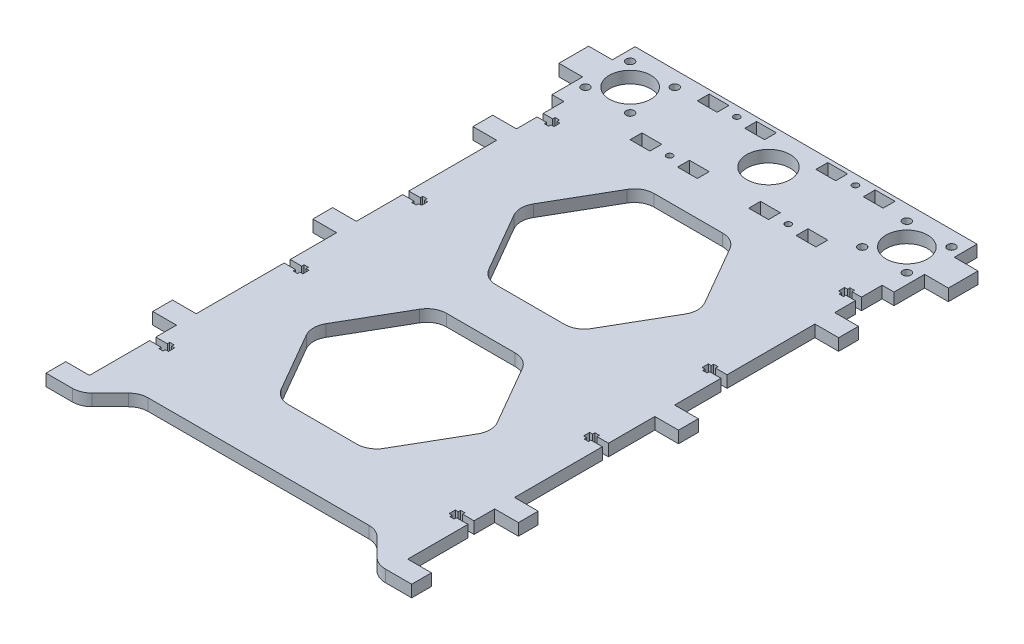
from build123d import *

# Parameters (mm, degrees)
SKETCH_1_R          = 10.5
SKETCH_1_R_2        = 1.55
SKETCH_1_R_3        = 2.05
SKETCH_1_W          = 10
SKETCH_1_H          = 6
EXTRUDE_2_DEPTH     = 6
CUT_EXTRUDE_4_DEPTH = 182.224308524
CUT_EXTRUDE_5_DEPTH = 182.224308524
FILLET_1_R          = 10


with BuildPart() as part:
    # Sketch 1 → Extrude 2 (new body)
    with BuildSketch(Plane(origin=(0, 0, 0), x_dir=(1, 0, 0), z_dir=(0, 1, 0))):
        with BuildLine():
            Line((86.5, 152), (86.5, 140.5))
            Line((86.5, 140.5), (98.5, 140.5))
            Line((98.5, 140.5), (98.5, 125.5))
            Line((98.5, 125.5), (86.5, 125.5))
            Line((86.5, 125.5), (86.5, 110))
            Line((86.5, 110), (80.5, 110))
            Line((80.5, 110), (80.5, 99.55))
            Line((80.5, 99.55), (75.7, 99.55))
            Line((75.7, 99.55), (75.7, 100.75))
            Line((75.7, 100.75), (73.5, 100.75))
            Line((73.5, 100.75), (73.5, 99.55))
            Line((73.5, 99.55), (72, 99.55))
            Line((72, 99.55), (72, 96.45))
            Line((72, 96.45), (73.5, 96.45))
            Line((73.5, 96.45), (73.5, 95.25))
            Line((73.5, 95.25), (75.7, 95.25))
            Line((75.7, 95.25), (75.7, 96.45))
            Line((75.7, 96.45), (80.5, 96.45))
            Line((80.5, 96.45), (80.5, 86))
            Line((80.5, 86), (92.5, 86))
            Line((92.5, 86), (92.5, 76))
            Line((92.5, 76), (80.5, 76))
            Line((80.5, 76), (80.5, 31.55))
            Line((80.5, 31.55), (74.7, 31.55))
            Line((74.7, 31.55), (74.7, 32.75))
            Line((74.7, 32.75), (72.5, 32.75))
            Line((72.5, 32.75), (72.5, 31.55))
            Line((72.5, 31.55), (71, 31.55))
            Line((71, 31.55), (71, 28.45))
            Line((71, 28.45), (72.5, 28.45))
            Line((72.5, 28.45), (72.5, 27.25))
            Line((72.5, 27.25), (74.7, 27.25))
            Line((74.7, 27.25), (74.7, 28.45))
            Line((74.7, 28.45), (80.5, 28.45))
            Line((80.5, 28.45), (80.5, 5))
            Line((80.5, 5), (92.5, 5))
            Line((92.5, 5), (92.5, -5))
            Line((92.5, -5), (80.5, -5))
            Line((80.5, -5), (80.5, -28.45))
            Line((80.5, -28.45), (74.7, -28.45))
            Line((74.7, -28.45), (74.7, -27.25))
            Line((74.7, -27.25), (72.5, -27.25))
            Line((72.5, -27.25), (72.5, -28.45))
            Line((72.5, -28.45), (71, -28.45))
            Line((71, -28.45), (71, -31.55))
            Line((71, -31.55), (72.5, -31.55))
            Line((72.5, -31.55), (72.5, -32.75))
            Line((72.5, -32.75), (74.7, -32.75))
            Line((74.7, -32.75), (74.7, -31.55))
            Line((74.7, -31.55), (80.5, -31.55))
            Line((80.5, -31.55), (80.5, -76))
            Line((80.5, -76), (92.5, -76))
            Line((92.5, -76), (92.5, -86))
            Line((92.5, -86), (80.5, -86))
            Line((80.5, -86), (80.5, -96.45))
            Line((80.5, -96.45), (74.7, -96.45))
            Line((74.7, -96.45), (74.7, -95.25))
            Line((74.7, -95.25), (72.5, -95.25))
            Line((72.5, -95.25), (72.5, -96.45))
            Line((72.5, -96.45), (71, -96.45))
            Line((71, -96.45), (71, -99.55))
            Line((71, -99.55), (72.5, -99.55))
            Line((72.5, -99.55), (72.5, -100.75))
            Line((72.5, -100.75), (74.7, -100.75))
            Line((74.7, -100.75), (74.7, -99.55))
            Line((74.7, -99.55), (80.5, -99.55))
            Line((80.5, -99.55), (80.5, -130))
            Line((80.5, -130), (92.5, -130))
            Line((92.5, -130), (92.5, -140))
            Line((92.5, -140), (0, -140))
            Line((0, -140), (0, 122))
            ThreePointArc((0, 122), (11, 133), (0, 144))
            Line((0, 144), (0, 152))
            Line((0, 152), (86.5, 152))
        make_face()
        with Locations(Location((70, 133, 0), (0, 0, 270))):
            Circle(SKETCH_1_R, mode=Mode.SUBTRACT)
        with Locations(Location((30, 147, 0), (0, 0, 270))):
            Circle(SKETCH_1_R_2, mode=Mode.SUBTRACT)
        with Locations(Location((58.7, 144.3, 0), (0, 0, 270))):
            Circle(SKETCH_1_R_3, mode=Mode.SUBTRACT)
        with Locations(Location((81.3, 144.3, 0), (0, 0, 270))):
            Circle(SKETCH_1_R_3, mode=Mode.SUBTRACT)
        with Locations(Location((58.7, 121.7, 0), (0, 0, 270))):
            Circle(SKETCH_1_R_3, mode=Mode.SUBTRACT)
        with Locations(Location((81.3, 121.7, 0), (0, 0, 270))):
            Circle(SKETCH_1_R_3, mode=Mode.SUBTRACT)
        with Locations(Location((30, 113, 0), (0, 0, 270))):
            Circle(SKETCH_1_R_2, mode=Mode.SUBTRACT)
        with Locations((18, 147)):
            Rectangle(SKETCH_1_W, SKETCH_1_H, mode=Mode.SUBTRACT)
        with Locations((42, 147)):
            Rectangle(SKETCH_1_W, SKETCH_1_H, mode=Mode.SUBTRACT)
        with Locations((18, 113)):
            Rectangle(SKETCH_1_W, SKETCH_1_H, mode=Mode.SUBTRACT)
        with Locations((42, 113)):
            Rectangle(SKETCH_1_W, SKETCH_1_H, mode=Mode.SUBTRACT)
    extrude(amount=EXTRUDE_2_DEPTH)

    # Mirror 1: part across plane


with BuildPart() as part_1:
    add(part.part)
    add(part.part.mirror(Plane(origin=(0, 6, -122), x_dir=(0, 0, 1), z_dir=(1, 0, 0))))

    # Sketch 2 → Cut-Extrude 4 (cut, through all)
    with BuildSketch(Plane(origin=(0, 6, 0), x_dir=(1, 0, 0), z_dir=(0, 1, 0))):
        Polygon((23.094010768, 12.5), (46.188021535, 52.5), (23.094010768, 92.5), (-23.094010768, 92.5), (-46.188021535, 52.5), (-23.094010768, 12.5), align=None)
        Polygon((23.094010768, -12.5), (46.188021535, -52.5), (23.094010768, -92.5), (-23.094010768, -92.5), (-46.188021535, -52.5), (-23.094010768, -12.5), align=None)
    extrude(amount=-CUT_EXTRUDE_4_DEPTH, mode=Mode.SUBTRACT)

    # Sketch 3 → Cut-Extrude 5 (cut, through all)
    with BuildSketch(Plane(origin=(0, 6, 0), x_dir=(1, 0, 0), z_dir=(0, 1, 0))):
        Polygon((-75, -140), (75, -140), (60, -125), (-60, -125), align=None)
    extrude(amount=-CUT_EXTRUDE_5_DEPTH, mode=Mode.SUBTRACT)

    # Fillet 1
    fillet_1_edges = [part_1.edges().sort_by_distance(p)[0] for p in [
        (-23.094010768, 3, 12.5),
        (23.094010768, 3, 12.5),
        (46.188021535, 3, 52.5),
        (23.094010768, 3, 92.5),
        (-23.094010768, 3, 92.5),
        (-46.188021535, 3, 52.5),
        (23.094010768, 3, -12.5),
        (-23.094010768, 3, -12.5),
        (-46.188021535, 3, -52.5),
        (-23.094010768, 3, -92.5),
        (23.094010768, 3, -92.5),
        (46.188021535, 3, -52.5),
        (60, 3, 125),
        (75, 3, 140),
        (-75, 3, 140),
        (-60, 3, 125),
    ]]
    fillet(fillet_1_edges, radius=FILLET_1_R)


solid = part_1.part
